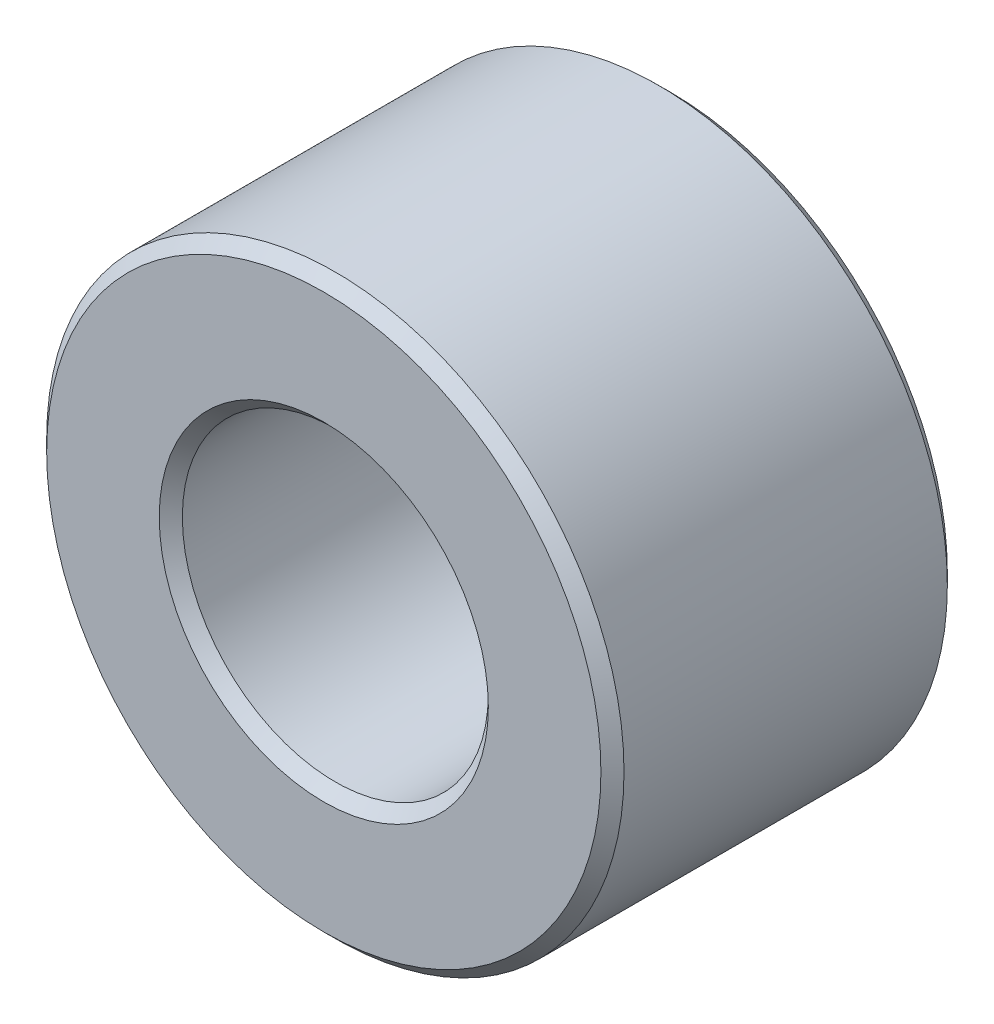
from build123d import *

# Parameters (mm, degrees)
SKETCH1_R           = 5
SKETCH1_R_2         = 2.65
BOSS_EXTRUDE2_DEPTH = 3
CHAMFER3_SIZE       = 0.2


with BuildPart() as part:
    # Sketch1 → Boss-Extrude2 (new, symmetric)
    with BuildSketch(Plane.XY):
        Circle(SKETCH1_R)
        Circle(SKETCH1_R_2, mode=Mode.SUBTRACT)
    extrude(amount=BOSS_EXTRUDE2_DEPTH, both=True)

    # Chamfer3
    chamfer3_edges = [part.edges().sort_by_distance(p)[0] for p in [
        (-5, 0, -3),
        (-5, 0, 3),
        (-2.65, 0, -3),
        (-2.65, 0, 3),
    ]]
    chamfer(chamfer3_edges, length=CHAMFER3_SIZE)


solid = part.part
